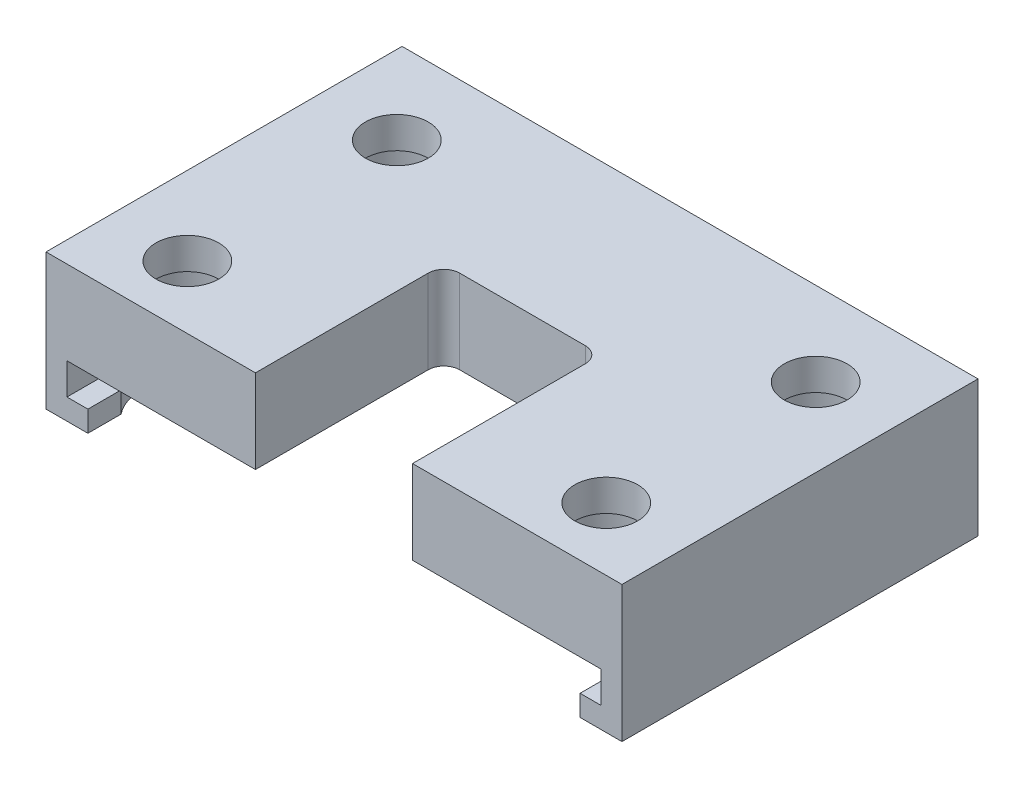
ISO-10303-21;
HEADER;
FILE_DESCRIPTION(('STEP AP214'),'2;1');
FILE_NAME('part.step','',(''),(''),'','','');
FILE_SCHEMA(('AUTOMOTIVE_DESIGN { 1 0 10303 214 1 1 1 1 }'));
ENDSEC;
DATA;
#1=APPLICATION_CONTEXT('core data for automotive mechanical design processes');
#2=APPLICATION_PROTOCOL_DEFINITION('international standard','automotive_design',2000,#1);
#3=PRODUCT_CONTEXT('',#1,'mechanical');
#4=PRODUCT('Part','Part','',(#3));
#5=PRODUCT_RELATED_PRODUCT_CATEGORY('part','',(#4));
#6=PRODUCT_DEFINITION_FORMATION('','',#4);
#7=PRODUCT_DEFINITION_CONTEXT('part definition',#1,'design');
#8=PRODUCT_DEFINITION('design','',#6,#7);
#9=PRODUCT_DEFINITION_SHAPE('','',#8);
#10=(LENGTH_UNIT() NAMED_UNIT(*) SI_UNIT(.MILLI.,.METRE.));
#11=(NAMED_UNIT(*) PLANE_ANGLE_UNIT() SI_UNIT($,.RADIAN.));
#12=(NAMED_UNIT(*) SI_UNIT($,.STERADIAN.) SOLID_ANGLE_UNIT());
#13=UNCERTAINTY_MEASURE_WITH_UNIT(LENGTH_MEASURE(1.E-05),#10,'distance_accuracy_value','');
#14=(GEOMETRIC_REPRESENTATION_CONTEXT(3) GLOBAL_UNCERTAINTY_ASSIGNED_CONTEXT((#13)) GLOBAL_UNIT_ASSIGNED_CONTEXT((#10,
#11,#12)) REPRESENTATION_CONTEXT('',''));
#15=CARTESIAN_POINT('',(0.,0.,0.));
#16=DIRECTION('',(0.,0.,1.));
#17=DIRECTION('',(1.,0.,0.));
#18=AXIS2_PLACEMENT_3D('',#15,#16,#17);
#19=CARTESIAN_POINT('',(0.,3.05,0.));
#20=DIRECTION('',(0.,-1.,0.));
#21=DIRECTION('',(0.,0.,-1.));
#22=AXIS2_PLACEMENT_3D('',#19,#20,#21);
#23=PLANE('',#22);
#24=CARTESIAN_POINT('',(7.5,3.05,8.));
#25=DIRECTION('',(0.,-1.,0.));
#26=DIRECTION('',(0.,0.,-1.));
#27=AXIS2_PLACEMENT_3D('',#24,#25,#26);
#28=CIRCLE('',#27,4.50000000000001);
#29=CARTESIAN_POINT('',(7.5,3.05,3.49999999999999));
#30=VERTEX_POINT('',#29);
#31=EDGE_CURVE('E289',#30,#30,#28,.T.);
#32=ORIENTED_EDGE('',*,*,#31,.F.);
#33=EDGE_LOOP('',(#32));
#34=FACE_BOUND('',#33,.T.);
#35=CARTESIAN_POINT('',(47.5,3.05,8.));
#36=DIRECTION('',(0.,-1.,0.));
#37=DIRECTION('',(0.,0.,-1.));
#38=AXIS2_PLACEMENT_3D('',#35,#36,#37);
#39=CIRCLE('',#38,4.50000000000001);
#40=CARTESIAN_POINT('',(47.5,3.05,3.49999999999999));
#41=VERTEX_POINT('',#40);
#42=EDGE_CURVE('E301',#41,#41,#39,.T.);
#43=ORIENTED_EDGE('',*,*,#42,.F.);
#44=EDGE_LOOP('',(#43));
#45=FACE_BOUND('',#44,.T.);
#46=CARTESIAN_POINT('',(7.5,3.05,28.));
#47=DIRECTION('',(0.,-1.,0.));
#48=DIRECTION('',(0.,0.,-1.));
#49=AXIS2_PLACEMENT_3D('',#46,#47,#48);
#50=CIRCLE('',#49,4.50000000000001);
#51=CARTESIAN_POINT('',(7.5,3.05,23.5));
#52=VERTEX_POINT('',#51);
#53=EDGE_CURVE('E313',#52,#52,#50,.T.);
#54=ORIENTED_EDGE('',*,*,#53,.F.);
#55=EDGE_LOOP('',(#54));
#56=FACE_BOUND('',#55,.T.);
#57=CARTESIAN_POINT('',(47.5,3.05,28.));
#58=DIRECTION('',(0.,-1.,0.));
#59=DIRECTION('',(0.,0.,-1.));
#60=AXIS2_PLACEMENT_3D('',#57,#58,#59);
#61=CIRCLE('',#60,4.50000000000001);
#62=CARTESIAN_POINT('',(47.5,3.05,23.5));
#63=VERTEX_POINT('',#62);
#64=EDGE_CURVE('E325',#63,#63,#61,.T.);
#65=ORIENTED_EDGE('',*,*,#64,.F.);
#66=EDGE_LOOP('',(#65));
#67=FACE_BOUND('',#66,.T.);
#68=DIRECTION('',(1.,0.,0.));
#69=VECTOR('',#68,1.);
#70=CARTESIAN_POINT('',(0.,3.05,34.));
#71=LINE('',#70,#69);
#72=CARTESIAN_POINT('',(2.,3.05,34.));
#73=VERTEX_POINT('',#72);
#74=CARTESIAN_POINT('',(20.,3.05,34.));
#75=VERTEX_POINT('',#74);
#76=EDGE_CURVE('E363',#73,#75,#71,.T.);
#77=ORIENTED_EDGE('',*,*,#76,.F.);
#78=DIRECTION('',(0.,0.,-1.));
#79=VECTOR('',#78,1.);
#80=CARTESIAN_POINT('',(2.,3.05,31.));
#81=LINE('',#80,#79);
#82=CARTESIAN_POINT('',(2.,3.05,0.));
#83=VERTEX_POINT('',#82);
#84=EDGE_CURVE('E54',#73,#83,#81,.T.);
#85=ORIENTED_EDGE('',*,*,#84,.T.);
#86=DIRECTION('',(1.,0.,0.));
#87=VECTOR('',#86,1.);
#88=CARTESIAN_POINT('',(0.,3.05,0.));
#89=LINE('',#88,#87);
#90=CARTESIAN_POINT('',(53.,3.05,0.));
#91=VERTEX_POINT('',#90);
#92=EDGE_CURVE('E424',#83,#91,#89,.T.);
#93=ORIENTED_EDGE('',*,*,#92,.T.);
#94=DIRECTION('',(0.,0.,-1.));
#95=VECTOR('',#94,1.);
#96=CARTESIAN_POINT('',(53.,3.05,31.));
#97=LINE('',#96,#95);
#98=CARTESIAN_POINT('',(53.,3.05,34.));
#99=VERTEX_POINT('',#98);
#100=EDGE_CURVE('E400',#99,#91,#97,.T.);
#101=ORIENTED_EDGE('',*,*,#100,.F.);
#102=DIRECTION('',(1.,0.,0.));
#103=VECTOR('',#102,1.);
#104=CARTESIAN_POINT('',(0.,3.05,34.));
#105=LINE('',#104,#103);
#106=CARTESIAN_POINT('',(35.,3.05,34.));
#107=VERTEX_POINT('',#106);
#108=EDGE_CURVE('E365',#107,#99,#105,.T.);
#109=ORIENTED_EDGE('',*,*,#108,.F.);
#110=DIRECTION('',(0.,0.,1.));
#111=VECTOR('',#110,1.);
#112=CARTESIAN_POINT('',(35.,3.05,0.));
#113=LINE('',#112,#111);
#114=CARTESIAN_POINT('',(35.,3.05,17.5));
#115=VERTEX_POINT('',#114);
#116=EDGE_CURVE('E368',#115,#107,#113,.T.);
#117=ORIENTED_EDGE('',*,*,#116,.F.);
#118=CARTESIAN_POINT('',(33.5,3.05,17.5));
#119=DIRECTION('',(0.,-1.,0.));
#120=DIRECTION('',(0.,0.,-1.));
#121=AXIS2_PLACEMENT_3D('',#118,#119,#120);
#122=CIRCLE('',#121,1.5);
#123=CARTESIAN_POINT('',(33.5,3.05,16.));
#124=VERTEX_POINT('',#123);
#125=EDGE_CURVE('E454',#115,#124,#122,.F.);
#126=ORIENTED_EDGE('',*,*,#125,.T.);
#127=DIRECTION('',(1.,0.,0.));
#128=VECTOR('',#127,1.);
#129=CARTESIAN_POINT('',(0.,3.05,16.));
#130=LINE('',#129,#128);
#131=CARTESIAN_POINT('',(21.5,3.05,16.));
#132=VERTEX_POINT('',#131);
#133=EDGE_CURVE('E370',#132,#124,#130,.T.);
#134=ORIENTED_EDGE('',*,*,#133,.F.);
#135=CARTESIAN_POINT('',(21.5,3.05,17.5));
#136=DIRECTION('',(0.,-1.,0.));
#137=DIRECTION('',(0.,0.,-1.));
#138=AXIS2_PLACEMENT_3D('',#135,#136,#137);
#139=CIRCLE('',#138,1.5);
#140=CARTESIAN_POINT('',(20.,3.05,17.5));
#141=VERTEX_POINT('',#140);
#142=EDGE_CURVE('E450',#132,#141,#139,.F.);
#143=ORIENTED_EDGE('',*,*,#142,.T.);
#144=DIRECTION('',(0.,0.,-1.));
#145=VECTOR('',#144,1.);
#146=CARTESIAN_POINT('',(20.,3.05,0.));
#147=LINE('',#146,#145);
#148=EDGE_CURVE('E353',#75,#141,#147,.T.);
#149=ORIENTED_EDGE('',*,*,#148,.F.);
#150=EDGE_LOOP('',(#77,#85,#93,#101,#109,#117,#126,#134,#143,#149));
#151=FACE_BOUND('',#150,.T.);
#152=ADVANCED_FACE('F39',(#34,#45,#56,#67,#151),#23,.T.);
#153=CARTESIAN_POINT('',(4.,-1.95,31.));
#154=DIRECTION('',(-1.,0.,0.));
#155=DIRECTION('',(0.,0.,1.));
#156=AXIS2_PLACEMENT_3D('',#153,#154,#155);
#157=PLANE('',#156);
#158=DIRECTION('',(0.,0.,-1.));
#159=VECTOR('',#158,1.);
#160=CARTESIAN_POINT('',(4.,0.0499999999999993,31.));
#161=LINE('',#160,#159);
#162=CARTESIAN_POINT('',(4.,0.0499999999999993,5.17157287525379));
#163=VERTEX_POINT('',#162);
#164=CARTESIAN_POINT('',(4.,0.0499999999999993,0.));
#165=VERTEX_POINT('',#164);
#166=EDGE_CURVE('E222',#163,#165,#161,.T.);
#167=ORIENTED_EDGE('',*,*,#166,.F.);
#168=DIRECTION('',(0.,-1.,0.));
#169=VECTOR('',#168,1.);
#170=CARTESIAN_POINT('',(4.,0.0499999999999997,5.17157287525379));
#171=LINE('',#170,#169);
#172=CARTESIAN_POINT('',(4.,-1.95,5.17157287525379));
#173=VERTEX_POINT('',#172);
#174=EDGE_CURVE('E62',#163,#173,#171,.T.);
#175=ORIENTED_EDGE('',*,*,#174,.T.);
#176=DIRECTION('',(0.,0.,-1.));
#177=VECTOR('',#176,1.);
#178=CARTESIAN_POINT('',(4.,-1.95,31.));
#179=LINE('',#178,#177);
#180=CARTESIAN_POINT('',(4.,-1.95,0.));
#181=VERTEX_POINT('',#180);
#182=EDGE_CURVE('E415',#173,#181,#179,.T.);
#183=ORIENTED_EDGE('',*,*,#182,.T.);
#184=DIRECTION('',(0.,1.,0.));
#185=VECTOR('',#184,1.);
#186=CARTESIAN_POINT('',(4.,-1.95,0.));
#187=LINE('',#186,#185);
#188=EDGE_CURVE('E406',#181,#165,#187,.T.);
#189=ORIENTED_EDGE('',*,*,#188,.T.);
#190=EDGE_LOOP('',(#167,#175,#183,#189));
#191=FACE_BOUND('',#190,.T.);
#192=ADVANCED_FACE('F507',(#191),#157,.F.);
#193=CARTESIAN_POINT('',(4.,-1.95,25.1715728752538));
#194=VERTEX_POINT('',#193);
#195=CARTESIAN_POINT('',(4.,-1.95,10.8284271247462));
#196=VERTEX_POINT('',#195);
#197=EDGE_CURVE('E421',#194,#196,#179,.T.);
#198=ORIENTED_EDGE('',*,*,#197,.T.);
#199=DIRECTION('',(0.,-1.,0.));
#200=VECTOR('',#199,1.);
#201=CARTESIAN_POINT('',(4.,0.0499999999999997,10.8284271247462));
#202=LINE('',#201,#200);
#203=CARTESIAN_POINT('',(4.,0.0499999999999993,10.8284271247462));
#204=VERTEX_POINT('',#203);
#205=EDGE_CURVE('E285',#196,#204,#202,.F.);
#206=ORIENTED_EDGE('',*,*,#205,.T.);
#207=CARTESIAN_POINT('',(4.,0.0499999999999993,25.1715728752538));
#208=VERTEX_POINT('',#207);
#209=EDGE_CURVE('E416',#208,#204,#161,.T.);
#210=ORIENTED_EDGE('',*,*,#209,.F.);
#211=DIRECTION('',(0.,-1.,0.));
#212=VECTOR('',#211,1.);
#213=CARTESIAN_POINT('',(4.,0.0499999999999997,25.1715728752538));
#214=LINE('',#213,#212);
#215=EDGE_CURVE('E282',#208,#194,#214,.T.);
#216=ORIENTED_EDGE('',*,*,#215,.T.);
#217=EDGE_LOOP('',(#198,#206,#210,#216));
#218=FACE_BOUND('',#217,.T.);
#219=ADVANCED_FACE('F513',(#218),#157,.F.);
#220=CARTESIAN_POINT('',(51.,-1.95,31.));
#221=DIRECTION('',(1.,0.,0.));
#222=DIRECTION('',(0.,0.,-1.));
#223=AXIS2_PLACEMENT_3D('',#220,#221,#222);
#224=PLANE('',#223);
#225=DIRECTION('',(0.,0.,-1.));
#226=VECTOR('',#225,1.);
#227=CARTESIAN_POINT('',(51.,0.0499999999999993,31.));
#228=LINE('',#227,#226);
#229=CARTESIAN_POINT('',(51.,0.0500000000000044,25.1715728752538));
#230=VERTEX_POINT('',#229);
#231=CARTESIAN_POINT('',(51.,0.0500000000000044,10.8284271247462));
#232=VERTEX_POINT('',#231);
#233=EDGE_CURVE('E398',#230,#232,#228,.T.);
#234=ORIENTED_EDGE('',*,*,#233,.T.);
#235=DIRECTION('',(0.,-1.,0.));
#236=VECTOR('',#235,1.);
#237=CARTESIAN_POINT('',(51.,0.050000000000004,10.8284271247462));
#238=LINE('',#237,#236);
#239=CARTESIAN_POINT('',(51.,-1.95,10.8284271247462));
#240=VERTEX_POINT('',#239);
#241=EDGE_CURVE('E276',#232,#240,#238,.T.);
#242=ORIENTED_EDGE('',*,*,#241,.T.);
#243=DIRECTION('',(0.,0.,-1.));
#244=VECTOR('',#243,1.);
#245=CARTESIAN_POINT('',(51.,-1.95,31.));
#246=LINE('',#245,#244);
#247=CARTESIAN_POINT('',(51.,-1.95,25.1715728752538));
#248=VERTEX_POINT('',#247);
#249=EDGE_CURVE('E393',#248,#240,#246,.T.);
#250=ORIENTED_EDGE('',*,*,#249,.F.);
#251=DIRECTION('',(0.,-1.,0.));
#252=VECTOR('',#251,1.);
#253=CARTESIAN_POINT('',(51.,0.050000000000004,25.1715728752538));
#254=LINE('',#253,#252);
#255=EDGE_CURVE('E266',#248,#230,#254,.F.);
#256=ORIENTED_EDGE('',*,*,#255,.T.);
#257=EDGE_LOOP('',(#234,#242,#250,#256));
#258=FACE_BOUND('',#257,.T.);
#259=ADVANCED_FACE('F464',(#258),#224,.F.);
#260=CARTESIAN_POINT('',(51.,0.0499999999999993,34.));
#261=VERTEX_POINT('',#260);
#262=CARTESIAN_POINT('',(51.,0.0500000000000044,30.8284271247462));
#263=VERTEX_POINT('',#262);
#264=EDGE_CURVE('E394',#261,#263,#228,.T.);
#265=ORIENTED_EDGE('',*,*,#264,.T.);
#266=DIRECTION('',(0.,-1.,0.));
#267=VECTOR('',#266,1.);
#268=CARTESIAN_POINT('',(51.,0.050000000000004,30.8284271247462));
#269=LINE('',#268,#267);
#270=CARTESIAN_POINT('',(51.,-1.95,30.8284271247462));
#271=VERTEX_POINT('',#270);
#272=EDGE_CURVE('E270',#263,#271,#269,.T.);
#273=ORIENTED_EDGE('',*,*,#272,.T.);
#274=CARTESIAN_POINT('',(51.,-1.95,34.));
#275=VERTEX_POINT('',#274);
#276=EDGE_CURVE('E389',#275,#271,#246,.T.);
#277=ORIENTED_EDGE('',*,*,#276,.F.);
#278=DIRECTION('',(0.,-1.,0.));
#279=VECTOR('',#278,1.);
#280=CARTESIAN_POINT('',(51.,0.0499999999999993,34.));
#281=LINE('',#280,#279);
#282=EDGE_CURVE('E246',#261,#275,#281,.T.);
#283=ORIENTED_EDGE('',*,*,#282,.F.);
#284=EDGE_LOOP('',(#265,#273,#277,#283));
#285=FACE_BOUND('',#284,.T.);
#286=ADVANCED_FACE('F488',(#285),#224,.F.);
#287=CARTESIAN_POINT('',(55.,11.05,0.));
#288=DIRECTION('',(1.,0.,0.));
#289=DIRECTION('',(0.,0.,-1.));
#290=AXIS2_PLACEMENT_3D('',#287,#288,#289);
#291=PLANE('',#290);
#292=DIRECTION('',(0.,1.,0.));
#293=VECTOR('',#292,1.);
#294=CARTESIAN_POINT('',(55.,-1.95,34.));
#295=LINE('',#294,#293);
#296=CARTESIAN_POINT('',(55.,-1.95,34.));
#297=VERTEX_POINT('',#296);
#298=CARTESIAN_POINT('',(55.,11.05,34.));
#299=VERTEX_POINT('',#298);
#300=EDGE_CURVE('E354',#297,#299,#295,.T.);
#301=ORIENTED_EDGE('',*,*,#300,.F.);
#302=DIRECTION('',(0.,0.,-1.));
#303=VECTOR('',#302,1.);
#304=CARTESIAN_POINT('',(55.,-1.95,31.));
#305=LINE('',#304,#303);
#306=CARTESIAN_POINT('',(55.,-1.95,0.));
#307=VERTEX_POINT('',#306);
#308=EDGE_CURVE('E385',#297,#307,#305,.T.);
#309=ORIENTED_EDGE('',*,*,#308,.T.);
#310=DIRECTION('',(0.,-1.,0.));
#311=VECTOR('',#310,1.);
#312=CARTESIAN_POINT('',(55.,11.05,0.));
#313=LINE('',#312,#311);
#314=CARTESIAN_POINT('',(55.,11.05,0.));
#315=VERTEX_POINT('',#314);
#316=EDGE_CURVE('E435',#315,#307,#313,.T.);
#317=ORIENTED_EDGE('',*,*,#316,.F.);
#318=DIRECTION('',(0.,0.,1.));
#319=VECTOR('',#318,1.);
#320=CARTESIAN_POINT('',(55.,11.05,0.));
#321=LINE('',#320,#319);
#322=EDGE_CURVE('E425',#315,#299,#321,.T.);
#323=ORIENTED_EDGE('',*,*,#322,.T.);
#324=EDGE_LOOP('',(#301,#309,#317,#323));
#325=FACE_BOUND('',#324,.T.);
#326=ADVANCED_FACE('F481',(#325),#291,.T.);
#327=CARTESIAN_POINT('',(0.,11.05,0.));
#328=DIRECTION('',(0.,0.,-1.));
#329=DIRECTION('',(-1.,0.,0.));
#330=AXIS2_PLACEMENT_3D('',#327,#328,#329);
#331=PLANE('',#330);
#332=ORIENTED_EDGE('',*,*,#92,.F.);
#333=DIRECTION('',(0.,1.,0.));
#334=VECTOR('',#333,1.);
#335=CARTESIAN_POINT('',(2.,0.0499999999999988,0.));
#336=LINE('',#335,#334);
#337=CARTESIAN_POINT('',(2.,0.0499999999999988,0.));
#338=VERTEX_POINT('',#337);
#339=EDGE_CURVE('E410',#338,#83,#336,.T.);
#340=ORIENTED_EDGE('',*,*,#339,.F.);
#341=DIRECTION('',(-1.,0.,0.));
#342=VECTOR('',#341,1.);
#343=CARTESIAN_POINT('',(4.,0.0499999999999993,0.));
#344=LINE('',#343,#342);
#345=EDGE_CURVE('E220',#165,#338,#344,.T.);
#346=ORIENTED_EDGE('',*,*,#345,.F.);
#347=ORIENTED_EDGE('',*,*,#188,.F.);
#348=DIRECTION('',(1.,0.,0.));
#349=VECTOR('',#348,1.);
#350=CARTESIAN_POINT('',(0.,-1.95,0.));
#351=LINE('',#350,#349);
#352=CARTESIAN_POINT('',(0.,-1.95,0.));
#353=VERTEX_POINT('',#352);
#354=EDGE_CURVE('E403',#353,#181,#351,.T.);
#355=ORIENTED_EDGE('',*,*,#354,.F.);
#356=DIRECTION('',(0.,-1.,0.));
#357=VECTOR('',#356,1.);
#358=CARTESIAN_POINT('',(0.,11.05,0.));
#359=LINE('',#358,#357);
#360=CARTESIAN_POINT('',(0.,11.05,0.));
#361=VERTEX_POINT('',#360);
#362=EDGE_CURVE('E433',#361,#353,#359,.T.);
#363=ORIENTED_EDGE('',*,*,#362,.F.);
#364=DIRECTION('',(1.,0.,0.));
#365=VECTOR('',#364,1.);
#366=CARTESIAN_POINT('',(0.,11.05,0.));
#367=LINE('',#366,#365);
#368=EDGE_CURVE('E430',#361,#315,#367,.T.);
#369=ORIENTED_EDGE('',*,*,#368,.T.);
#370=ORIENTED_EDGE('',*,*,#316,.T.);
#371=DIRECTION('',(1.,0.,0.));
#372=VECTOR('',#371,1.);
#373=CARTESIAN_POINT('',(55.,-1.95,0.));
#374=LINE('',#373,#372);
#375=CARTESIAN_POINT('',(51.,-1.95,0.));
#376=VERTEX_POINT('',#375);
#377=EDGE_CURVE('E382',#376,#307,#374,.T.);
#378=ORIENTED_EDGE('',*,*,#377,.F.);
#379=DIRECTION('',(0.,-1.,0.));
#380=VECTOR('',#379,1.);
#381=CARTESIAN_POINT('',(51.,-1.95,0.));
#382=LINE('',#381,#380);
#383=CARTESIAN_POINT('',(51.,0.0499999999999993,0.));
#384=VERTEX_POINT('',#383);
#385=EDGE_CURVE('E379',#384,#376,#382,.T.);
#386=ORIENTED_EDGE('',*,*,#385,.F.);
#387=DIRECTION('',(-1.,0.,0.));
#388=VECTOR('',#387,1.);
#389=CARTESIAN_POINT('',(51.,0.0499999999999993,0.));
#390=LINE('',#389,#388);
#391=CARTESIAN_POINT('',(53.,0.0499999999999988,0.));
#392=VERTEX_POINT('',#391);
#393=EDGE_CURVE('E376',#392,#384,#390,.T.);
#394=ORIENTED_EDGE('',*,*,#393,.F.);
#395=DIRECTION('',(0.,-1.,0.));
#396=VECTOR('',#395,1.);
#397=CARTESIAN_POINT('',(53.,0.0499999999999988,0.));
#398=LINE('',#397,#396);
#399=EDGE_CURVE('E373',#91,#392,#398,.T.);
#400=ORIENTED_EDGE('',*,*,#399,.F.);
#401=EDGE_LOOP('',(#332,#340,#346,#347,#355,#363,#369,#370,#378,#386,#394,#400));
#402=FACE_BOUND('',#401,.T.);
#403=ADVANCED_FACE('F475',(#402),#331,.T.);
#404=CARTESIAN_POINT('',(0.,11.05,31.));
#405=DIRECTION('',(-1.,0.,0.));
#406=DIRECTION('',(0.,0.,1.));
#407=AXIS2_PLACEMENT_3D('',#404,#405,#406);
#408=PLANE('',#407);
#409=DIRECTION('',(0.,1.,0.));
#410=VECTOR('',#409,1.);
#411=CARTESIAN_POINT('',(0.,-1.95,34.));
#412=LINE('',#411,#410);
#413=CARTESIAN_POINT('',(0.,-1.95,34.));
#414=VERTEX_POINT('',#413);
#415=CARTESIAN_POINT('',(0.,11.05,34.));
#416=VERTEX_POINT('',#415);
#417=EDGE_CURVE('E356',#414,#416,#412,.T.);
#418=ORIENTED_EDGE('',*,*,#417,.T.);
#419=DIRECTION('',(0.,0.,-1.));
#420=VECTOR('',#419,1.);
#421=CARTESIAN_POINT('',(0.,11.05,31.));
#422=LINE('',#421,#420);
#423=EDGE_CURVE('E428',#416,#361,#422,.T.);
#424=ORIENTED_EDGE('',*,*,#423,.T.);
#425=ORIENTED_EDGE('',*,*,#362,.T.);
#426=DIRECTION('',(0.,0.,-1.));
#427=VECTOR('',#426,1.);
#428=CARTESIAN_POINT('',(0.,-1.95,31.));
#429=LINE('',#428,#427);
#430=EDGE_CURVE('E420',#414,#353,#429,.T.);
#431=ORIENTED_EDGE('',*,*,#430,.F.);
#432=EDGE_LOOP('',(#418,#424,#425,#431));
#433=FACE_BOUND('',#432,.T.);
#434=ADVANCED_FACE('F525',(#433),#408,.T.);
#435=CARTESIAN_POINT('',(0.,11.05,0.));
#436=DIRECTION('',(0.,-1.,0.));
#437=DIRECTION('',(0.,0.,-1.));
#438=AXIS2_PLACEMENT_3D('',#435,#436,#437);
#439=PLANE('',#438);
#440=CARTESIAN_POINT('',(7.5,11.05,8.));
#441=DIRECTION('',(0.,-1.,0.));
#442=DIRECTION('',(0.,0.,-1.));
#443=AXIS2_PLACEMENT_3D('',#440,#441,#442);
#444=CIRCLE('',#443,3.00000000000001);
#445=CARTESIAN_POINT('',(7.5,11.05,4.99999999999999));
#446=VERTEX_POINT('',#445);
#447=EDGE_CURVE('E298',#446,#446,#444,.T.);
#448=ORIENTED_EDGE('',*,*,#447,.T.);
#449=EDGE_LOOP('',(#448));
#450=FACE_BOUND('',#449,.T.);
#451=CARTESIAN_POINT('',(47.5,11.05,8.));
#452=DIRECTION('',(0.,-1.,0.));
#453=DIRECTION('',(0.,0.,-1.));
#454=AXIS2_PLACEMENT_3D('',#451,#452,#453);
#455=CIRCLE('',#454,3.00000000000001);
#456=CARTESIAN_POINT('',(47.5,11.05,4.99999999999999));
#457=VERTEX_POINT('',#456);
#458=EDGE_CURVE('E310',#457,#457,#455,.T.);
#459=ORIENTED_EDGE('',*,*,#458,.T.);
#460=EDGE_LOOP('',(#459));
#461=FACE_BOUND('',#460,.T.);
#462=CARTESIAN_POINT('',(7.5,11.05,28.));
#463=DIRECTION('',(0.,-1.,0.));
#464=DIRECTION('',(0.,0.,-1.));
#465=AXIS2_PLACEMENT_3D('',#462,#463,#464);
#466=CIRCLE('',#465,3.00000000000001);
#467=CARTESIAN_POINT('',(7.5,11.05,25.));
#468=VERTEX_POINT('',#467);
#469=EDGE_CURVE('E322',#468,#468,#466,.T.);
#470=ORIENTED_EDGE('',*,*,#469,.T.);
#471=EDGE_LOOP('',(#470));
#472=FACE_BOUND('',#471,.T.);
#473=CARTESIAN_POINT('',(47.5,11.05,28.));
#474=DIRECTION('',(0.,-1.,0.));
#475=DIRECTION('',(0.,0.,-1.));
#476=AXIS2_PLACEMENT_3D('',#473,#474,#475);
#477=CIRCLE('',#476,3.00000000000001);
#478=CARTESIAN_POINT('',(47.5,11.05,25.));
#479=VERTEX_POINT('',#478);
#480=EDGE_CURVE('E334',#479,#479,#477,.T.);
#481=ORIENTED_EDGE('',*,*,#480,.T.);
#482=EDGE_LOOP('',(#481));
#483=FACE_BOUND('',#482,.T.);
#484=DIRECTION('',(0.,0.,-1.));
#485=VECTOR('',#484,1.);
#486=CARTESIAN_POINT('',(35.,11.05,34.));
#487=LINE('',#486,#485);
#488=CARTESIAN_POINT('',(35.,11.05,34.));
#489=VERTEX_POINT('',#488);
#490=CARTESIAN_POINT('',(35.,11.05,17.5));
#491=VERTEX_POINT('',#490);
#492=EDGE_CURVE('E347',#489,#491,#487,.T.);
#493=ORIENTED_EDGE('',*,*,#492,.F.);
#494=DIRECTION('',(-1.,0.,0.));
#495=VECTOR('',#494,1.);
#496=CARTESIAN_POINT('',(55.,11.05,34.));
#497=LINE('',#496,#495);
#498=EDGE_CURVE('E344',#299,#489,#497,.T.);
#499=ORIENTED_EDGE('',*,*,#498,.F.);
#500=ORIENTED_EDGE('',*,*,#322,.F.);
#501=ORIENTED_EDGE('',*,*,#368,.F.);
#502=ORIENTED_EDGE('',*,*,#423,.F.);
#503=DIRECTION('',(-1.,0.,0.));
#504=VECTOR('',#503,1.);
#505=CARTESIAN_POINT('',(20.,11.05,34.));
#506=LINE('',#505,#504);
#507=CARTESIAN_POINT('',(20.,11.05,34.));
#508=VERTEX_POINT('',#507);
#509=EDGE_CURVE('E342',#508,#416,#506,.T.);
#510=ORIENTED_EDGE('',*,*,#509,.F.);
#511=DIRECTION('',(0.,0.,1.));
#512=VECTOR('',#511,1.);
#513=CARTESIAN_POINT('',(20.,11.05,16.));
#514=LINE('',#513,#512);
#515=CARTESIAN_POINT('',(20.,11.05,17.5));
#516=VERTEX_POINT('',#515);
#517=EDGE_CURVE('E340',#516,#508,#514,.T.);
#518=ORIENTED_EDGE('',*,*,#517,.F.);
#519=CARTESIAN_POINT('',(21.5,11.05,17.5));
#520=DIRECTION('',(0.,-1.,0.));
#521=DIRECTION('',(0.,0.,-1.));
#522=AXIS2_PLACEMENT_3D('',#519,#520,#521);
#523=CIRCLE('',#522,1.5);
#524=CARTESIAN_POINT('',(21.5,11.05,16.));
#525=VERTEX_POINT('',#524);
#526=EDGE_CURVE('E448',#516,#525,#523,.T.);
#527=ORIENTED_EDGE('',*,*,#526,.T.);
#528=DIRECTION('',(-1.,0.,0.));
#529=VECTOR('',#528,1.);
#530=CARTESIAN_POINT('',(35.,11.05,16.));
#531=LINE('',#530,#529);
#532=CARTESIAN_POINT('',(33.5,11.05,16.));
#533=VERTEX_POINT('',#532);
#534=EDGE_CURVE('E337',#533,#525,#531,.T.);
#535=ORIENTED_EDGE('',*,*,#534,.F.);
#536=CARTESIAN_POINT('',(33.5,11.05,17.5));
#537=DIRECTION('',(0.,-1.,0.));
#538=DIRECTION('',(0.,0.,-1.));
#539=AXIS2_PLACEMENT_3D('',#536,#537,#538);
#540=CIRCLE('',#539,1.5);
#541=EDGE_CURVE('E452',#533,#491,#540,.T.);
#542=ORIENTED_EDGE('',*,*,#541,.T.);
#543=EDGE_LOOP('',(#493,#499,#500,#501,#502,#510,#518,#527,#535,#542));
#544=FACE_BOUND('',#543,.T.);
#545=ADVANCED_FACE('F521',(#450,#461,#472,#483,#544),#439,.F.);
#546=CARTESIAN_POINT('',(0.,-1.95,31.));
#547=DIRECTION('',(0.,1.,0.));
#548=DIRECTION('',(-1.,0.,0.));
#549=AXIS2_PLACEMENT_3D('',#546,#547,#548);
#550=PLANE('',#549);
#551=ORIENTED_EDGE('',*,*,#182,.F.);
#552=CARTESIAN_POINT('',(7.5,-1.95,8.));
#553=DIRECTION('',(0.,-1.,0.));
#554=DIRECTION('',(1.,0.,0.));
#555=AXIS2_PLACEMENT_3D('',#552,#553,#554);
#556=CIRCLE('',#555,4.50000000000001);
#557=EDGE_CURVE('E260',#196,#173,#556,.T.);
#558=ORIENTED_EDGE('',*,*,#557,.F.);
#559=ORIENTED_EDGE('',*,*,#197,.F.);
#560=CARTESIAN_POINT('',(7.5,-1.95,28.));
#561=DIRECTION('',(0.,-1.,0.));
#562=DIRECTION('',(1.,0.,0.));
#563=AXIS2_PLACEMENT_3D('',#560,#561,#562);
#564=CIRCLE('',#563,4.50000000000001);
#565=CARTESIAN_POINT('',(4.,-1.95,30.8284271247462));
#566=VERTEX_POINT('',#565);
#567=EDGE_CURVE('E256',#566,#194,#564,.T.);
#568=ORIENTED_EDGE('',*,*,#567,.F.);
#569=CARTESIAN_POINT('',(4.,-1.95,34.));
#570=VERTEX_POINT('',#569);
#571=EDGE_CURVE('E417',#570,#566,#179,.T.);
#572=ORIENTED_EDGE('',*,*,#571,.F.);
#573=DIRECTION('',(1.,0.,0.));
#574=VECTOR('',#573,1.);
#575=CARTESIAN_POINT('',(0.,-1.95,34.));
#576=LINE('',#575,#574);
#577=EDGE_CURVE('E236',#414,#570,#576,.T.);
#578=ORIENTED_EDGE('',*,*,#577,.F.);
#579=ORIENTED_EDGE('',*,*,#430,.T.);
#580=ORIENTED_EDGE('',*,*,#354,.T.);
#581=EDGE_LOOP('',(#551,#558,#559,#568,#572,#578,#579,#580));
#582=FACE_BOUND('',#581,.T.);
#583=ADVANCED_FACE('F560',(#582),#550,.F.);
#584=ORIENTED_EDGE('',*,*,#571,.T.);
#585=DIRECTION('',(0.,-1.,0.));
#586=VECTOR('',#585,1.);
#587=CARTESIAN_POINT('',(4.,0.0499999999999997,30.8284271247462));
#588=LINE('',#587,#586);
#589=CARTESIAN_POINT('',(4.,0.0499999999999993,30.8284271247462));
#590=VERTEX_POINT('',#589);
#591=EDGE_CURVE('E279',#566,#590,#588,.F.);
#592=ORIENTED_EDGE('',*,*,#591,.T.);
#593=CARTESIAN_POINT('',(4.,0.0499999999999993,34.));
#594=VERTEX_POINT('',#593);
#595=EDGE_CURVE('E413',#594,#590,#161,.T.);
#596=ORIENTED_EDGE('',*,*,#595,.F.);
#597=DIRECTION('',(0.,1.,0.));
#598=VECTOR('',#597,1.);
#599=CARTESIAN_POINT('',(4.,-1.95,34.));
#600=LINE('',#599,#598);
#601=EDGE_CURVE('E232',#570,#594,#600,.T.);
#602=ORIENTED_EDGE('',*,*,#601,.F.);
#603=EDGE_LOOP('',(#584,#592,#596,#602));
#604=FACE_BOUND('',#603,.T.);
#605=ADVANCED_FACE('F516',(#604),#157,.F.);
#606=CARTESIAN_POINT('',(4.,0.0499999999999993,31.));
#607=DIRECTION('',(0.,-1.,0.));
#608=DIRECTION('',(1.,0.,0.));
#609=AXIS2_PLACEMENT_3D('',#606,#607,#608);
#610=PLANE('',#609);
#611=ORIENTED_EDGE('',*,*,#209,.T.);
#612=CARTESIAN_POINT('',(7.5,0.0499999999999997,8.));
#613=DIRECTION('',(0.,-1.,0.));
#614=DIRECTION('',(1.,0.,0.));
#615=AXIS2_PLACEMENT_3D('',#612,#613,#614);
#616=CIRCLE('',#615,4.50000000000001);
#617=EDGE_CURVE('E252',#204,#163,#616,.T.);
#618=ORIENTED_EDGE('',*,*,#617,.T.);
#619=ORIENTED_EDGE('',*,*,#166,.T.);
#620=ORIENTED_EDGE('',*,*,#345,.T.);
#621=DIRECTION('',(0.,0.,-1.));
#622=VECTOR('',#621,1.);
#623=CARTESIAN_POINT('',(2.,0.0499999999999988,31.));
#624=LINE('',#623,#622);
#625=CARTESIAN_POINT('',(2.,0.0499999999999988,34.));
#626=VERTEX_POINT('',#625);
#627=EDGE_CURVE('E213',#626,#338,#624,.T.);
#628=ORIENTED_EDGE('',*,*,#627,.F.);
#629=DIRECTION('',(-1.,0.,0.));
#630=VECTOR('',#629,1.);
#631=CARTESIAN_POINT('',(4.,0.0499999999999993,34.));
#632=LINE('',#631,#630);
#633=EDGE_CURVE('E218',#594,#626,#632,.T.);
#634=ORIENTED_EDGE('',*,*,#633,.F.);
#635=ORIENTED_EDGE('',*,*,#595,.T.);
#636=CARTESIAN_POINT('',(7.5,0.0499999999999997,28.));
#637=DIRECTION('',(0.,-1.,0.));
#638=DIRECTION('',(1.,0.,0.));
#639=AXIS2_PLACEMENT_3D('',#636,#637,#638);
#640=CIRCLE('',#639,4.50000000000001);
#641=EDGE_CURVE('E263',#590,#208,#640,.T.);
#642=ORIENTED_EDGE('',*,*,#641,.T.);
#643=EDGE_LOOP('',(#611,#618,#619,#620,#628,#634,#635,#642));
#644=FACE_BOUND('',#643,.T.);
#645=ADVANCED_FACE('F216',(#644),#610,.F.);
#646=CARTESIAN_POINT('',(2.,0.0499999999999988,31.));
#647=DIRECTION('',(-1.,0.,0.));
#648=DIRECTION('',(0.,0.,1.));
#649=AXIS2_PLACEMENT_3D('',#646,#647,#648);
#650=PLANE('',#649);
#651=ORIENTED_EDGE('',*,*,#627,.T.);
#652=ORIENTED_EDGE('',*,*,#339,.T.);
#653=ORIENTED_EDGE('',*,*,#84,.F.);
#654=DIRECTION('',(0.,1.,0.));
#655=VECTOR('',#654,1.);
#656=CARTESIAN_POINT('',(2.,0.0499999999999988,34.));
#657=LINE('',#656,#655);
#658=EDGE_CURVE('E228',#626,#73,#657,.T.);
#659=ORIENTED_EDGE('',*,*,#658,.F.);
#660=EDGE_LOOP('',(#651,#652,#653,#659));
#661=FACE_BOUND('',#660,.T.);
#662=ADVANCED_FACE('F234',(#661),#650,.F.);
#663=CARTESIAN_POINT('',(53.,0.0499999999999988,31.));
#664=DIRECTION('',(1.,0.,0.));
#665=DIRECTION('',(0.,0.,-1.));
#666=AXIS2_PLACEMENT_3D('',#663,#664,#665);
#667=PLANE('',#666);
#668=ORIENTED_EDGE('',*,*,#100,.T.);
#669=ORIENTED_EDGE('',*,*,#399,.T.);
#670=DIRECTION('',(0.,0.,-1.));
#671=VECTOR('',#670,1.);
#672=CARTESIAN_POINT('',(53.,0.0499999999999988,31.));
#673=LINE('',#672,#671);
#674=CARTESIAN_POINT('',(53.,0.0499999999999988,34.));
#675=VERTEX_POINT('',#674);
#676=EDGE_CURVE('E397',#675,#392,#673,.T.);
#677=ORIENTED_EDGE('',*,*,#676,.F.);
#678=DIRECTION('',(0.,-1.,0.));
#679=VECTOR('',#678,1.);
#680=CARTESIAN_POINT('',(53.,3.05,34.));
#681=LINE('',#680,#679);
#682=EDGE_CURVE('E235',#99,#675,#681,.T.);
#683=ORIENTED_EDGE('',*,*,#682,.F.);
#684=EDGE_LOOP('',(#668,#669,#677,#683));
#685=FACE_BOUND('',#684,.T.);
#686=ADVANCED_FACE('F637',(#685),#667,.F.);
#687=CARTESIAN_POINT('',(51.,0.0499999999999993,31.));
#688=DIRECTION('',(0.,-1.,0.));
#689=DIRECTION('',(1.,0.,0.));
#690=AXIS2_PLACEMENT_3D('',#687,#688,#689);
#691=PLANE('',#690);
#692=CARTESIAN_POINT('',(51.,0.0500000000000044,5.1715728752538));
#693=VERTEX_POINT('',#692);
#694=EDGE_CURVE('E392',#693,#384,#228,.T.);
#695=ORIENTED_EDGE('',*,*,#694,.F.);
#696=CARTESIAN_POINT('',(47.5,0.050000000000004,8.));
#697=DIRECTION('',(0.,-1.,0.));
#698=DIRECTION('',(1.,0.,0.));
#699=AXIS2_PLACEMENT_3D('',#696,#697,#698);
#700=CIRCLE('',#699,4.50000000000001);
#701=EDGE_CURVE('E257',#693,#232,#700,.T.);
#702=ORIENTED_EDGE('',*,*,#701,.T.);
#703=ORIENTED_EDGE('',*,*,#233,.F.);
#704=CARTESIAN_POINT('',(47.5,0.050000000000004,28.));
#705=DIRECTION('',(0.,-1.,0.));
#706=DIRECTION('',(1.,0.,0.));
#707=AXIS2_PLACEMENT_3D('',#704,#705,#706);
#708=CIRCLE('',#707,4.50000000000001);
#709=EDGE_CURVE('E253',#230,#263,#708,.T.);
#710=ORIENTED_EDGE('',*,*,#709,.T.);
#711=ORIENTED_EDGE('',*,*,#264,.F.);
#712=DIRECTION('',(-1.,0.,0.));
#713=VECTOR('',#712,1.);
#714=CARTESIAN_POINT('',(53.,0.0499999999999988,34.));
#715=LINE('',#714,#713);
#716=EDGE_CURVE('E239',#675,#261,#715,.T.);
#717=ORIENTED_EDGE('',*,*,#716,.F.);
#718=ORIENTED_EDGE('',*,*,#676,.T.);
#719=ORIENTED_EDGE('',*,*,#393,.T.);
#720=EDGE_LOOP('',(#695,#702,#703,#710,#711,#717,#718,#719));
#721=FACE_BOUND('',#720,.T.);
#722=ADVANCED_FACE('F491',(#721),#691,.F.);
#723=CARTESIAN_POINT('',(51.,-1.95,5.1715728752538));
#724=VERTEX_POINT('',#723);
#725=EDGE_CURVE('E388',#724,#376,#246,.T.);
#726=ORIENTED_EDGE('',*,*,#725,.F.);
#727=DIRECTION('',(0.,-1.,0.));
#728=VECTOR('',#727,1.);
#729=CARTESIAN_POINT('',(51.,0.050000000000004,5.1715728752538));
#730=LINE('',#729,#728);
#731=EDGE_CURVE('E273',#724,#693,#730,.F.);
#732=ORIENTED_EDGE('',*,*,#731,.T.);
#733=ORIENTED_EDGE('',*,*,#694,.T.);
#734=ORIENTED_EDGE('',*,*,#385,.T.);
#735=EDGE_LOOP('',(#726,#732,#733,#734));
#736=FACE_BOUND('',#735,.T.);
#737=ADVANCED_FACE('F470',(#736),#224,.F.);
#738=CARTESIAN_POINT('',(55.,-1.95,31.));
#739=DIRECTION('',(0.,1.,0.));
#740=DIRECTION('',(-1.,0.,0.));
#741=AXIS2_PLACEMENT_3D('',#738,#739,#740);
#742=PLANE('',#741);
#743=ORIENTED_EDGE('',*,*,#249,.T.);
#744=CARTESIAN_POINT('',(47.5,-1.95,8.));
#745=DIRECTION('',(0.,1.,0.));
#746=DIRECTION('',(-1.,0.,0.));
#747=AXIS2_PLACEMENT_3D('',#744,#745,#746);
#748=CIRCLE('',#747,4.50000000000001);
#749=EDGE_CURVE('E11',#240,#724,#748,.T.);
#750=ORIENTED_EDGE('',*,*,#749,.T.);
#751=ORIENTED_EDGE('',*,*,#725,.T.);
#752=ORIENTED_EDGE('',*,*,#377,.T.);
#753=ORIENTED_EDGE('',*,*,#308,.F.);
#754=DIRECTION('',(1.,0.,0.));
#755=VECTOR('',#754,1.);
#756=CARTESIAN_POINT('',(51.,-1.95,34.));
#757=LINE('',#756,#755);
#758=EDGE_CURVE('E249',#275,#297,#757,.T.);
#759=ORIENTED_EDGE('',*,*,#758,.F.);
#760=ORIENTED_EDGE('',*,*,#276,.T.);
#761=CARTESIAN_POINT('',(47.5,-1.95,28.));
#762=DIRECTION('',(0.,1.,0.));
#763=DIRECTION('',(-1.,0.,0.));
#764=AXIS2_PLACEMENT_3D('',#761,#762,#763);
#765=CIRCLE('',#764,4.50000000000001);
#766=EDGE_CURVE('E47',#271,#248,#765,.T.);
#767=ORIENTED_EDGE('',*,*,#766,.T.);
#768=EDGE_LOOP('',(#743,#750,#751,#752,#753,#759,#760,#767));
#769=FACE_BOUND('',#768,.T.);
#770=ADVANCED_FACE('F459',(#769),#742,.F.);
#771=CARTESIAN_POINT('',(35.,-1.95,16.));
#772=DIRECTION('',(0.,0.,-1.));
#773=DIRECTION('',(-1.,0.,0.));
#774=AXIS2_PLACEMENT_3D('',#771,#772,#773);
#775=PLANE('',#774);
#776=ORIENTED_EDGE('',*,*,#534,.T.);
#777=DIRECTION('',(0.,1.,0.));
#778=VECTOR('',#777,1.);
#779=CARTESIAN_POINT('',(21.5,3.05,16.));
#780=LINE('',#779,#778);
#781=EDGE_CURVE('E444',#525,#132,#780,.F.);
#782=ORIENTED_EDGE('',*,*,#781,.T.);
#783=ORIENTED_EDGE('',*,*,#133,.T.);
#784=DIRECTION('',(0.,1.,0.));
#785=VECTOR('',#784,1.);
#786=CARTESIAN_POINT('',(33.5,11.05,16.));
#787=LINE('',#786,#785);
#788=EDGE_CURVE('E441',#124,#533,#787,.T.);
#789=ORIENTED_EDGE('',*,*,#788,.T.);
#790=EDGE_LOOP('',(#776,#782,#783,#789));
#791=FACE_BOUND('',#790,.T.);
#792=ADVANCED_FACE('F620',(#791),#775,.F.);
#793=CARTESIAN_POINT('',(35.,-1.95,34.));
#794=DIRECTION('',(1.,0.,0.));
#795=DIRECTION('',(0.,0.,-1.));
#796=AXIS2_PLACEMENT_3D('',#793,#794,#795);
#797=PLANE('',#796);
#798=ORIENTED_EDGE('',*,*,#492,.T.);
#799=DIRECTION('',(0.,1.,0.));
#800=VECTOR('',#799,1.);
#801=CARTESIAN_POINT('',(35.,3.05,17.5));
#802=LINE('',#801,#800);
#803=EDGE_CURVE('E446',#491,#115,#802,.F.);
#804=ORIENTED_EDGE('',*,*,#803,.T.);
#805=ORIENTED_EDGE('',*,*,#116,.T.);
#806=DIRECTION('',(0.,1.,0.));
#807=VECTOR('',#806,1.);
#808=CARTESIAN_POINT('',(35.,-1.95,34.));
#809=LINE('',#808,#807);
#810=EDGE_CURVE('E351',#107,#489,#809,.T.);
#811=ORIENTED_EDGE('',*,*,#810,.T.);
#812=EDGE_LOOP('',(#798,#804,#805,#811));
#813=FACE_BOUND('',#812,.T.);
#814=ADVANCED_FACE('F617',(#813),#797,.F.);
#815=CARTESIAN_POINT('',(55.,-1.95,34.));
#816=DIRECTION('',(0.,0.,-1.));
#817=DIRECTION('',(-1.,0.,0.));
#818=AXIS2_PLACEMENT_3D('',#815,#816,#817);
#819=PLANE('',#818);
#820=ORIENTED_EDGE('',*,*,#108,.T.);
#821=ORIENTED_EDGE('',*,*,#682,.T.);
#822=ORIENTED_EDGE('',*,*,#716,.T.);
#823=ORIENTED_EDGE('',*,*,#282,.T.);
#824=ORIENTED_EDGE('',*,*,#758,.T.);
#825=ORIENTED_EDGE('',*,*,#300,.T.);
#826=ORIENTED_EDGE('',*,*,#498,.T.);
#827=ORIENTED_EDGE('',*,*,#810,.F.);
#828=EDGE_LOOP('',(#820,#821,#822,#823,#824,#825,#826,#827));
#829=FACE_BOUND('',#828,.T.);
#830=ADVANCED_FACE('F483',(#829),#819,.F.);
#831=CARTESIAN_POINT('',(20.,-1.95,34.));
#832=DIRECTION('',(0.,0.,-1.));
#833=DIRECTION('',(-1.,0.,0.));
#834=AXIS2_PLACEMENT_3D('',#831,#832,#833);
#835=PLANE('',#834);
#836=ORIENTED_EDGE('',*,*,#417,.F.);
#837=ORIENTED_EDGE('',*,*,#577,.T.);
#838=ORIENTED_EDGE('',*,*,#601,.T.);
#839=ORIENTED_EDGE('',*,*,#633,.T.);
#840=ORIENTED_EDGE('',*,*,#658,.T.);
#841=ORIENTED_EDGE('',*,*,#76,.T.);
#842=DIRECTION('',(0.,1.,0.));
#843=VECTOR('',#842,1.);
#844=CARTESIAN_POINT('',(20.,-1.95,34.));
#845=LINE('',#844,#843);
#846=EDGE_CURVE('E350',#75,#508,#845,.T.);
#847=ORIENTED_EDGE('',*,*,#846,.T.);
#848=ORIENTED_EDGE('',*,*,#509,.T.);
#849=EDGE_LOOP('',(#836,#837,#838,#839,#840,#841,#847,#848));
#850=FACE_BOUND('',#849,.T.);
#851=ADVANCED_FACE('F227',(#850),#835,.F.);
#852=CARTESIAN_POINT('',(20.,-1.95,16.));
#853=DIRECTION('',(-1.,0.,0.));
#854=DIRECTION('',(0.,0.,1.));
#855=AXIS2_PLACEMENT_3D('',#852,#853,#854);
#856=PLANE('',#855);
#857=ORIENTED_EDGE('',*,*,#148,.T.);
#858=DIRECTION('',(0.,1.,0.));
#859=VECTOR('',#858,1.);
#860=CARTESIAN_POINT('',(20.,11.05,17.5));
#861=LINE('',#860,#859);
#862=EDGE_CURVE('E437',#141,#516,#861,.T.);
#863=ORIENTED_EDGE('',*,*,#862,.T.);
#864=ORIENTED_EDGE('',*,*,#517,.T.);
#865=ORIENTED_EDGE('',*,*,#846,.F.);
#866=EDGE_LOOP('',(#857,#863,#864,#865));
#867=FACE_BOUND('',#866,.T.);
#868=ADVANCED_FACE('F550',(#867),#856,.F.);
#869=CARTESIAN_POINT('',(47.5,3.05,28.));
#870=DIRECTION('',(0.,-1.,0.));
#871=DIRECTION('',(0.,0.,-1.));
#872=AXIS2_PLACEMENT_3D('',#869,#870,#871);
#873=CYLINDRICAL_SURFACE('',#872,3.00000000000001);
#874=ORIENTED_EDGE('',*,*,#480,.F.);
#875=EDGE_LOOP('',(#874));
#876=FACE_BOUND('',#875,.T.);
#877=CARTESIAN_POINT('',(47.5,8.05,28.));
#878=DIRECTION('',(0.,-1.,0.));
#879=DIRECTION('',(0.,0.,-1.));
#880=AXIS2_PLACEMENT_3D('',#877,#878,#879);
#881=CIRCLE('',#880,3.00000000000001);
#882=CARTESIAN_POINT('',(47.5,8.05,25.));
#883=VERTEX_POINT('',#882);
#884=EDGE_CURVE('E331',#883,#883,#881,.T.);
#885=ORIENTED_EDGE('',*,*,#884,.T.);
#886=EDGE_LOOP('',(#885));
#887=FACE_BOUND('',#886,.T.);
#888=ADVANCED_FACE('F612',(#876,#887),#873,.F.);
#889=CARTESIAN_POINT('',(50.5,8.05,28.));
#890=DIRECTION('',(0.,1.,0.));
#891=DIRECTION('',(0.,0.,1.));
#892=AXIS2_PLACEMENT_3D('',#889,#890,#891);
#893=PLANE('',#892);
#894=ORIENTED_EDGE('',*,*,#884,.F.);
#895=EDGE_LOOP('',(#894));
#896=FACE_BOUND('',#895,.T.);
#897=CARTESIAN_POINT('',(47.5,8.05,28.));
#898=DIRECTION('',(0.,-1.,0.));
#899=DIRECTION('',(0.,0.,-1.));
#900=AXIS2_PLACEMENT_3D('',#897,#898,#899);
#901=CIRCLE('',#900,4.50000000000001);
#902=CARTESIAN_POINT('',(47.5,8.05,23.5));
#903=VERTEX_POINT('',#902);
#904=EDGE_CURVE('E328',#903,#903,#901,.T.);
#905=ORIENTED_EDGE('',*,*,#904,.T.);
#906=EDGE_LOOP('',(#905));
#907=FACE_BOUND('',#906,.T.);
#908=ADVANCED_FACE('F608',(#896,#907),#893,.F.);
#909=CARTESIAN_POINT('',(47.5,3.05,28.));
#910=DIRECTION('',(0.,-1.,0.));
#911=DIRECTION('',(0.,0.,-1.));
#912=AXIS2_PLACEMENT_3D('',#909,#910,#911);
#913=CYLINDRICAL_SURFACE('',#912,4.50000000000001);
#914=ORIENTED_EDGE('',*,*,#904,.F.);
#915=EDGE_LOOP('',(#914));
#916=FACE_BOUND('',#915,.T.);
#917=ORIENTED_EDGE('',*,*,#64,.T.);
#918=EDGE_LOOP('',(#917));
#919=FACE_BOUND('',#918,.T.);
#920=ADVANCED_FACE('F604',(#916,#919),#913,.F.);
#921=CARTESIAN_POINT('',(7.5,3.05,28.));
#922=DIRECTION('',(0.,-1.,0.));
#923=DIRECTION('',(0.,0.,-1.));
#924=AXIS2_PLACEMENT_3D('',#921,#922,#923);
#925=CYLINDRICAL_SURFACE('',#924,3.00000000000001);
#926=ORIENTED_EDGE('',*,*,#469,.F.);
#927=EDGE_LOOP('',(#926));
#928=FACE_BOUND('',#927,.T.);
#929=CARTESIAN_POINT('',(7.5,8.05,28.));
#930=DIRECTION('',(0.,-1.,0.));
#931=DIRECTION('',(0.,0.,-1.));
#932=AXIS2_PLACEMENT_3D('',#929,#930,#931);
#933=CIRCLE('',#932,3.00000000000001);
#934=CARTESIAN_POINT('',(7.5,8.05,25.));
#935=VERTEX_POINT('',#934);
#936=EDGE_CURVE('E319',#935,#935,#933,.T.);
#937=ORIENTED_EDGE('',*,*,#936,.T.);
#938=EDGE_LOOP('',(#937));
#939=FACE_BOUND('',#938,.T.);
#940=ADVANCED_FACE('F600',(#928,#939),#925,.F.);
#941=CARTESIAN_POINT('',(10.5,8.05,28.));
#942=DIRECTION('',(0.,1.,0.));
#943=DIRECTION('',(0.,0.,1.));
#944=AXIS2_PLACEMENT_3D('',#941,#942,#943);
#945=PLANE('',#944);
#946=ORIENTED_EDGE('',*,*,#936,.F.);
#947=EDGE_LOOP('',(#946));
#948=FACE_BOUND('',#947,.T.);
#949=CARTESIAN_POINT('',(7.5,8.05,28.));
#950=DIRECTION('',(0.,-1.,0.));
#951=DIRECTION('',(0.,0.,-1.));
#952=AXIS2_PLACEMENT_3D('',#949,#950,#951);
#953=CIRCLE('',#952,4.50000000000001);
#954=CARTESIAN_POINT('',(7.5,8.05,23.5));
#955=VERTEX_POINT('',#954);
#956=EDGE_CURVE('E316',#955,#955,#953,.T.);
#957=ORIENTED_EDGE('',*,*,#956,.T.);
#958=EDGE_LOOP('',(#957));
#959=FACE_BOUND('',#958,.T.);
#960=ADVANCED_FACE('F596',(#948,#959),#945,.F.);
#961=CARTESIAN_POINT('',(7.5,3.05,28.));
#962=DIRECTION('',(0.,-1.,0.));
#963=DIRECTION('',(0.,0.,-1.));
#964=AXIS2_PLACEMENT_3D('',#961,#962,#963);
#965=CYLINDRICAL_SURFACE('',#964,4.50000000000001);
#966=ORIENTED_EDGE('',*,*,#956,.F.);
#967=EDGE_LOOP('',(#966));
#968=FACE_BOUND('',#967,.T.);
#969=ORIENTED_EDGE('',*,*,#53,.T.);
#970=EDGE_LOOP('',(#969));
#971=FACE_BOUND('',#970,.T.);
#972=ADVANCED_FACE('F592',(#968,#971),#965,.F.);
#973=CARTESIAN_POINT('',(47.5,3.05,8.));
#974=DIRECTION('',(0.,-1.,0.));
#975=DIRECTION('',(0.,0.,-1.));
#976=AXIS2_PLACEMENT_3D('',#973,#974,#975);
#977=CYLINDRICAL_SURFACE('',#976,3.00000000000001);
#978=ORIENTED_EDGE('',*,*,#458,.F.);
#979=EDGE_LOOP('',(#978));
#980=FACE_BOUND('',#979,.T.);
#981=CARTESIAN_POINT('',(47.5,8.05,8.));
#982=DIRECTION('',(0.,-1.,0.));
#983=DIRECTION('',(0.,0.,-1.));
#984=AXIS2_PLACEMENT_3D('',#981,#982,#983);
#985=CIRCLE('',#984,3.00000000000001);
#986=CARTESIAN_POINT('',(47.5,8.05,4.99999999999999));
#987=VERTEX_POINT('',#986);
#988=EDGE_CURVE('E307',#987,#987,#985,.T.);
#989=ORIENTED_EDGE('',*,*,#988,.T.);
#990=EDGE_LOOP('',(#989));
#991=FACE_BOUND('',#990,.T.);
#992=ADVANCED_FACE('F588',(#980,#991),#977,.F.);
#993=CARTESIAN_POINT('',(50.5,8.05,8.));
#994=DIRECTION('',(0.,1.,0.));
#995=DIRECTION('',(0.,0.,1.));
#996=AXIS2_PLACEMENT_3D('',#993,#994,#995);
#997=PLANE('',#996);
#998=ORIENTED_EDGE('',*,*,#988,.F.);
#999=EDGE_LOOP('',(#998));
#1000=FACE_BOUND('',#999,.T.);
#1001=CARTESIAN_POINT('',(47.5,8.05,8.));
#1002=DIRECTION('',(0.,-1.,0.));
#1003=DIRECTION('',(0.,0.,-1.));
#1004=AXIS2_PLACEMENT_3D('',#1001,#1002,#1003);
#1005=CIRCLE('',#1004,4.50000000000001);
#1006=CARTESIAN_POINT('',(47.5,8.05,3.49999999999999));
#1007=VERTEX_POINT('',#1006);
#1008=EDGE_CURVE('E304',#1007,#1007,#1005,.T.);
#1009=ORIENTED_EDGE('',*,*,#1008,.T.);
#1010=EDGE_LOOP('',(#1009));
#1011=FACE_BOUND('',#1010,.T.);
#1012=ADVANCED_FACE('F584',(#1000,#1011),#997,.F.);
#1013=CARTESIAN_POINT('',(47.5,3.05,8.));
#1014=DIRECTION('',(0.,-1.,0.));
#1015=DIRECTION('',(0.,0.,-1.));
#1016=AXIS2_PLACEMENT_3D('',#1013,#1014,#1015);
#1017=CYLINDRICAL_SURFACE('',#1016,4.50000000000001);
#1018=ORIENTED_EDGE('',*,*,#1008,.F.);
#1019=EDGE_LOOP('',(#1018));
#1020=FACE_BOUND('',#1019,.T.);
#1021=ORIENTED_EDGE('',*,*,#42,.T.);
#1022=EDGE_LOOP('',(#1021));
#1023=FACE_BOUND('',#1022,.T.);
#1024=ADVANCED_FACE('F580',(#1020,#1023),#1017,.F.);
#1025=CARTESIAN_POINT('',(7.5,3.05,8.));
#1026=DIRECTION('',(0.,-1.,0.));
#1027=DIRECTION('',(0.,0.,-1.));
#1028=AXIS2_PLACEMENT_3D('',#1025,#1026,#1027);
#1029=CYLINDRICAL_SURFACE('',#1028,3.00000000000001);
#1030=ORIENTED_EDGE('',*,*,#447,.F.);
#1031=EDGE_LOOP('',(#1030));
#1032=FACE_BOUND('',#1031,.T.);
#1033=CARTESIAN_POINT('',(7.5,8.05,8.));
#1034=DIRECTION('',(0.,-1.,0.));
#1035=DIRECTION('',(0.,0.,-1.));
#1036=AXIS2_PLACEMENT_3D('',#1033,#1034,#1035);
#1037=CIRCLE('',#1036,3.00000000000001);
#1038=CARTESIAN_POINT('',(7.5,8.05,4.99999999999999));
#1039=VERTEX_POINT('',#1038);
#1040=EDGE_CURVE('E295',#1039,#1039,#1037,.T.);
#1041=ORIENTED_EDGE('',*,*,#1040,.T.);
#1042=EDGE_LOOP('',(#1041));
#1043=FACE_BOUND('',#1042,.T.);
#1044=ADVANCED_FACE('F576',(#1032,#1043),#1029,.F.);
#1045=CARTESIAN_POINT('',(10.5,8.05,8.));
#1046=DIRECTION('',(0.,1.,0.));
#1047=DIRECTION('',(0.,0.,1.));
#1048=AXIS2_PLACEMENT_3D('',#1045,#1046,#1047);
#1049=PLANE('',#1048);
#1050=ORIENTED_EDGE('',*,*,#1040,.F.);
#1051=EDGE_LOOP('',(#1050));
#1052=FACE_BOUND('',#1051,.T.);
#1053=CARTESIAN_POINT('',(7.5,8.05,8.));
#1054=DIRECTION('',(0.,-1.,0.));
#1055=DIRECTION('',(0.,0.,-1.));
#1056=AXIS2_PLACEMENT_3D('',#1053,#1054,#1055);
#1057=CIRCLE('',#1056,4.50000000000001);
#1058=CARTESIAN_POINT('',(7.5,8.05,3.49999999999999));
#1059=VERTEX_POINT('',#1058);
#1060=EDGE_CURVE('E292',#1059,#1059,#1057,.T.);
#1061=ORIENTED_EDGE('',*,*,#1060,.T.);
#1062=EDGE_LOOP('',(#1061));
#1063=FACE_BOUND('',#1062,.T.);
#1064=ADVANCED_FACE('F539',(#1052,#1063),#1049,.F.);
#1065=CARTESIAN_POINT('',(7.5,3.05,8.));
#1066=DIRECTION('',(0.,-1.,0.));
#1067=DIRECTION('',(0.,0.,-1.));
#1068=AXIS2_PLACEMENT_3D('',#1065,#1066,#1067);
#1069=CYLINDRICAL_SURFACE('',#1068,4.50000000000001);
#1070=ORIENTED_EDGE('',*,*,#1060,.F.);
#1071=EDGE_LOOP('',(#1070));
#1072=FACE_BOUND('',#1071,.T.);
#1073=ORIENTED_EDGE('',*,*,#31,.T.);
#1074=EDGE_LOOP('',(#1073));
#1075=FACE_BOUND('',#1074,.T.);
#1076=ADVANCED_FACE('F532',(#1072,#1075),#1069,.F.);
#1077=CARTESIAN_POINT('',(21.5,-1.95,17.5));
#1078=DIRECTION('',(0.,-1.,0.));
#1079=DIRECTION('',(0.,0.,-1.));
#1080=AXIS2_PLACEMENT_3D('',#1077,#1078,#1079);
#1081=CYLINDRICAL_SURFACE('',#1080,1.5);
#1082=ORIENTED_EDGE('',*,*,#142,.F.);
#1083=ORIENTED_EDGE('',*,*,#781,.F.);
#1084=ORIENTED_EDGE('',*,*,#526,.F.);
#1085=ORIENTED_EDGE('',*,*,#862,.F.);
#1086=EDGE_LOOP('',(#1082,#1083,#1084,#1085));
#1087=FACE_BOUND('',#1086,.T.);
#1088=ADVANCED_FACE('F530',(#1087),#1081,.F.);
#1089=CARTESIAN_POINT('',(33.5,-1.95,17.5));
#1090=DIRECTION('',(0.,-1.,0.));
#1091=DIRECTION('',(0.,0.,-1.));
#1092=AXIS2_PLACEMENT_3D('',#1089,#1090,#1091);
#1093=CYLINDRICAL_SURFACE('',#1092,1.5);
#1094=ORIENTED_EDGE('',*,*,#125,.F.);
#1095=ORIENTED_EDGE('',*,*,#803,.F.);
#1096=ORIENTED_EDGE('',*,*,#541,.F.);
#1097=ORIENTED_EDGE('',*,*,#788,.F.);
#1098=EDGE_LOOP('',(#1094,#1095,#1096,#1097));
#1099=FACE_BOUND('',#1098,.T.);
#1100=ADVANCED_FACE('F41',(#1099),#1093,.F.);
#1101=CARTESIAN_POINT('',(47.5,0.050000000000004,28.));
#1102=DIRECTION('',(0.,-1.,0.));
#1103=DIRECTION('',(1.,0.,0.));
#1104=AXIS2_PLACEMENT_3D('',#1101,#1102,#1103);
#1105=CYLINDRICAL_SURFACE('',#1104,4.50000000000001);
#1106=ORIENTED_EDGE('',*,*,#709,.F.);
#1107=ORIENTED_EDGE('',*,*,#255,.F.);
#1108=ORIENTED_EDGE('',*,*,#766,.F.);
#1109=ORIENTED_EDGE('',*,*,#272,.F.);
#1110=EDGE_LOOP('',(#1106,#1107,#1108,#1109));
#1111=FACE_BOUND('',#1110,.T.);
#1112=ADVANCED_FACE('F489',(#1111),#1105,.F.);
#1113=CARTESIAN_POINT('',(47.5,0.050000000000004,8.));
#1114=DIRECTION('',(0.,-1.,0.));
#1115=DIRECTION('',(1.,0.,0.));
#1116=AXIS2_PLACEMENT_3D('',#1113,#1114,#1115);
#1117=CYLINDRICAL_SURFACE('',#1116,4.50000000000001);
#1118=ORIENTED_EDGE('',*,*,#701,.F.);
#1119=ORIENTED_EDGE('',*,*,#731,.F.);
#1120=ORIENTED_EDGE('',*,*,#749,.F.);
#1121=ORIENTED_EDGE('',*,*,#241,.F.);
#1122=EDGE_LOOP('',(#1118,#1119,#1120,#1121));
#1123=FACE_BOUND('',#1122,.T.);
#1124=ADVANCED_FACE('F493',(#1123),#1117,.F.);
#1125=CARTESIAN_POINT('',(7.5,0.0499999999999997,28.));
#1126=DIRECTION('',(0.,-1.,0.));
#1127=DIRECTION('',(1.,0.,0.));
#1128=AXIS2_PLACEMENT_3D('',#1125,#1126,#1127);
#1129=CYLINDRICAL_SURFACE('',#1128,4.50000000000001);
#1130=ORIENTED_EDGE('',*,*,#641,.F.);
#1131=ORIENTED_EDGE('',*,*,#591,.F.);
#1132=ORIENTED_EDGE('',*,*,#567,.T.);
#1133=ORIENTED_EDGE('',*,*,#215,.F.);
#1134=EDGE_LOOP('',(#1130,#1131,#1132,#1133));
#1135=FACE_BOUND('',#1134,.T.);
#1136=ADVANCED_FACE('F495',(#1135),#1129,.F.);
#1137=CARTESIAN_POINT('',(7.5,0.0499999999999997,8.));
#1138=DIRECTION('',(0.,-1.,0.));
#1139=DIRECTION('',(1.,0.,0.));
#1140=AXIS2_PLACEMENT_3D('',#1137,#1138,#1139);
#1141=CYLINDRICAL_SURFACE('',#1140,4.50000000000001);
#1142=ORIENTED_EDGE('',*,*,#617,.F.);
#1143=ORIENTED_EDGE('',*,*,#205,.F.);
#1144=ORIENTED_EDGE('',*,*,#557,.T.);
#1145=ORIENTED_EDGE('',*,*,#174,.F.);
#1146=EDGE_LOOP('',(#1142,#1143,#1144,#1145));
#1147=FACE_BOUND('',#1146,.T.);
#1148=ADVANCED_FACE('F501',(#1147),#1141,.F.);
#1149=CLOSED_SHELL('',(#152,#192,#219,#259,#286,#326,#403,#434,#545,#583,#605,#645,#662,#686,
#722,#737,#770,#792,#814,#830,#851,#868,#888,#908,#920,#940,#960,#972,#992,#1012,#1024,#1044,
#1064,#1076,#1088,#1100,#1112,#1124,#1136,#1148));
#1150=MANIFOLD_SOLID_BREP('B2',#1149);
#1151=ADVANCED_BREP_SHAPE_REPRESENTATION('',(#18,#1150),#14);
#1152=SHAPE_DEFINITION_REPRESENTATION(#9,#1151);
ENDSEC;
END-ISO-10303-21;
